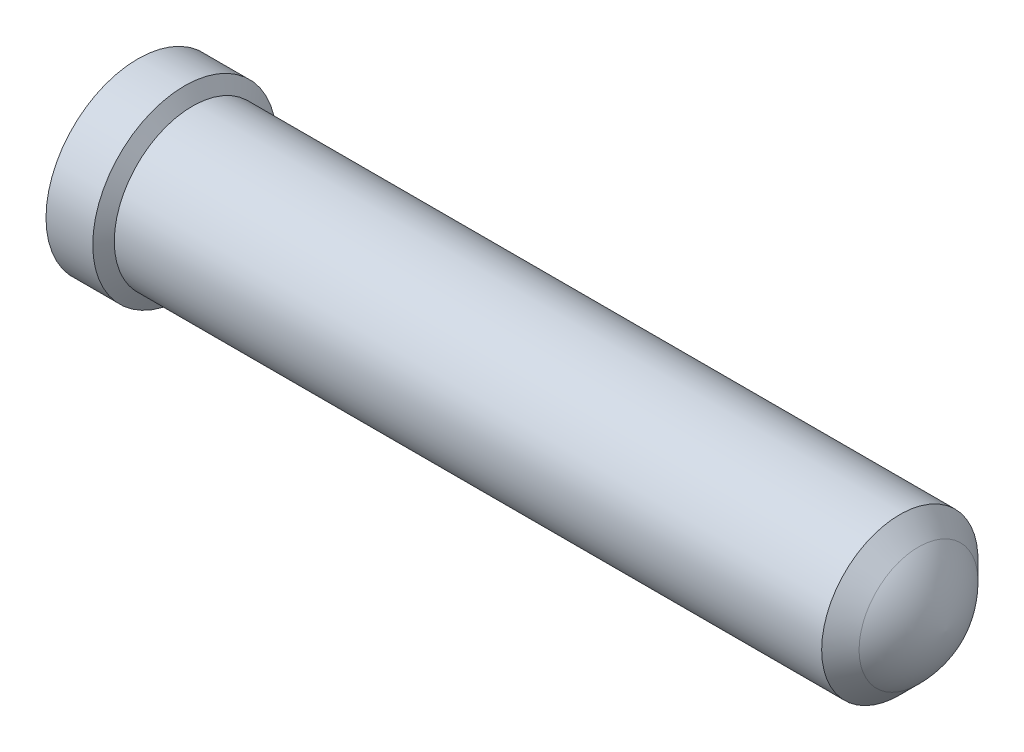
from build123d import *

# Parameters (mm, degrees)
HOLE2_D           = 0.9144
HOLE2_DEPTH       = 1.9304
HOLE2_CSINK_D     = 1.0922
HOLE2_CSINK_ANGLE = 90
HOLE2_TIP         = 0.274713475


with BuildPart() as part:
    # Sketch1 → RevolutionAngle1 (revolve)
    with BuildSketch(Plane.XY, mode=Mode.PRIVATE) as revolutionangle1_sk:
        with BuildLine():
            Line((0, 0), (0, 0.62357))
            Line((0, 0.62357), (0.3175, 0.62357))
            Line((0.3175, 0.62357), (0.371026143, 0.53086))
            Line((0.371026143, 0.53086), (5.175020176, 0.53086))
            Line((5.175020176, 0.53086), (5.302020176, 0.40386))
            ThreePointArc((5.302020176, 0.40386), (5.430654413, 0.218568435), (5.4864, 0))
            Line((5.4864, 0), (0, 0))
        make_face()
    revolve(revolutionangle1_sk.sketch.rotate(Axis((0, 0, 0), (1, 0, 0)), 90), axis=Axis((0, 0, 0), (1, 0, 0)))

    # Hole2
    with Locations(Plane(origin=(0, 0, 0), x_dir=(0, 0, -1), z_dir=(-1, 0, 0))):
        with Locations((0, 0)):
            CounterSinkHole(HOLE2_D / 2, HOLE2_CSINK_D / 2, depth=HOLE2_DEPTH, counter_sink_angle=HOLE2_CSINK_ANGLE)
            with Locations((0, 0, -(HOLE2_DEPTH + HOLE2_TIP / 2))):  # 118° drill point
                Cone(0, HOLE2_D / 2, HOLE2_TIP, mode=Mode.SUBTRACT)


solid = part.part
